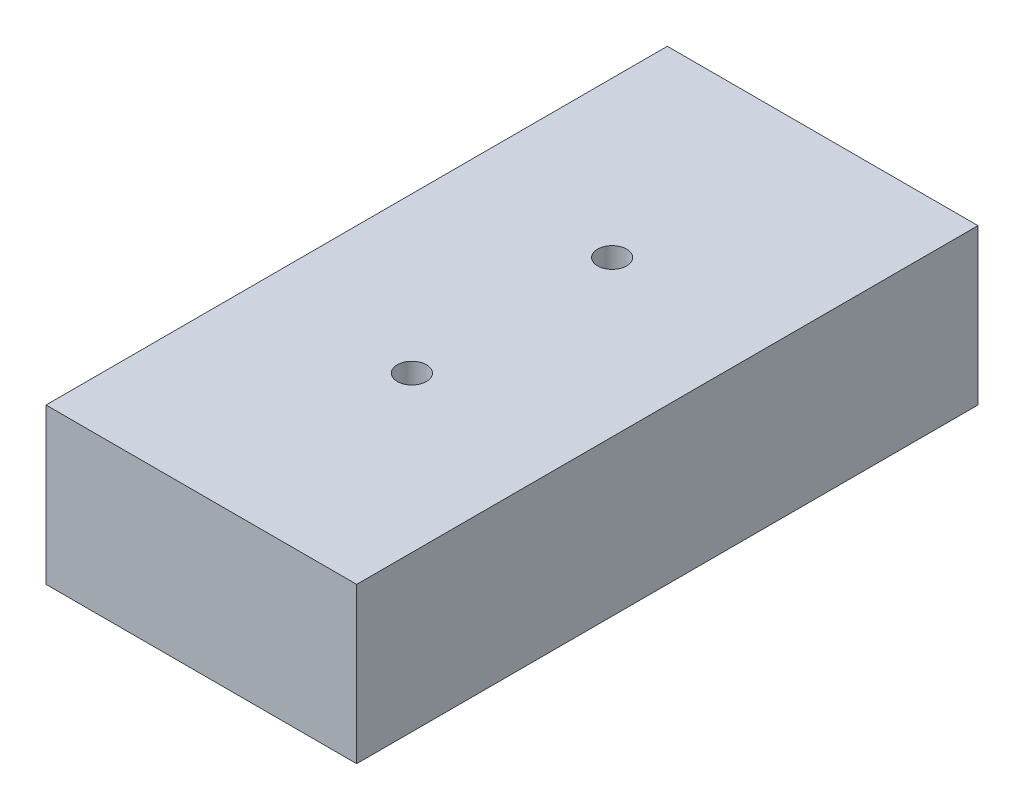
from build123d import *

# Parameters (mm, degrees)
SKETCH1_W                    = 101.6
SKETCH1_H                    = 50.8
EXTRUDE1_DEPTH               = 101.6
F_3_8_0_375_DIAMETER_HOLE1_D = 9.525


with BuildPart() as part:
    # Sketch1 → Extrude1 (new, symmetric)
    with BuildSketch(Plane.XY):
        Rectangle(SKETCH1_W, SKETCH1_H)
    extrude(amount=EXTRUDE1_DEPTH, both=True)

    # 3_8 _0.375_ Diameter Hole1 (through all)
    with Locations(Plane(origin=(0, 25.4, 0), x_dir=(-1, 0, 0), z_dir=(0, 1, 0))):
        with Locations((0, 32.750961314), (0, -32.750961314)):
            Hole(F_3_8_0_375_DIAMETER_HOLE1_D / 2)


solid = part.part
